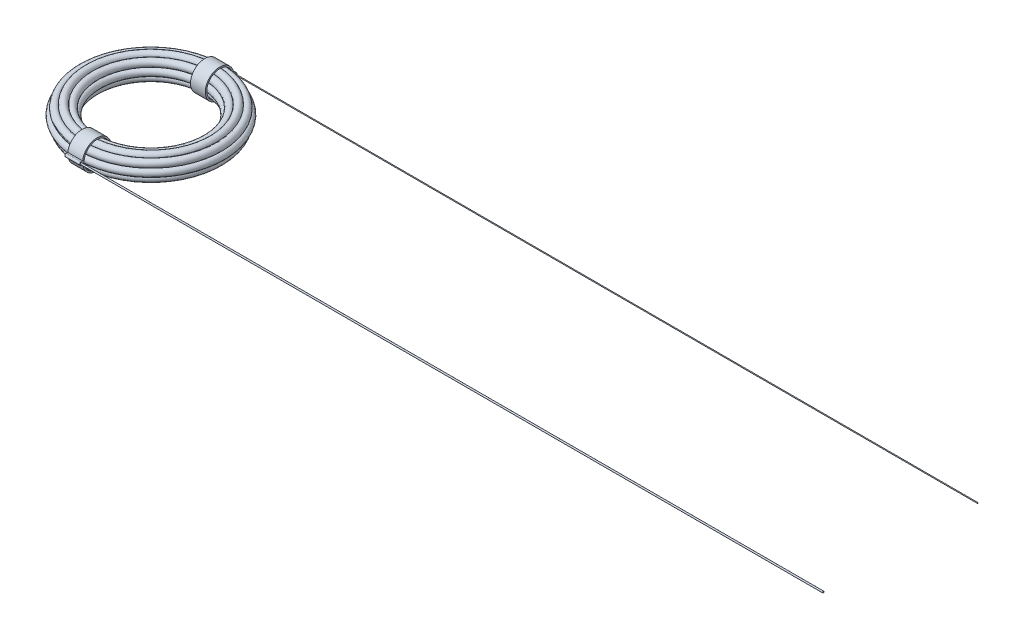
from build123d import *

# Parameters (mm, degrees)
CROQUIS51_R             = 26
SALIENTE_EXTRUIR1_DEPTH = 15
MATRIZC2_COUNT          = 2
CROQUIS55_R             = 1.5
SALIENTE_EXTRUIR2_DEPTH = 1500
CROQUIS56_R             = 0.75
SALIENTE_EXTRUIR3_DEPTH = 1500
CROQUIS57_RX            = 20
CROQUIS57_RY            = 15
CORTAR_EXTRUIR2_DEPTH   = 10
CORTAR_EXTRUIR2_TAPER   = 42
CROQUIS58_R             = 5
SALIENTE_EXTRUIR4_DEPTH = 1


with BuildPart() as part:
    # Croquis1 → Revoluci_n1 (revolve)
    with BuildSketch(Plane(origin=(0, 0, 0), x_dir=(0, 0, -1), z_dir=(1, 0, 0))):
        with BuildLine():
            ThreePointArc((-143.056659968, 7.47931345), (-150, 0), (-143.056659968, -7.47931345))
            ThreePointArc((-143.056659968, -7.47931345), (-142.67766953, -17.67766953), (-132.47931345, -18.056659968))
            ThreePointArc((-132.47931345, -18.056659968), (-125, -25), (-117.52068655, -18.056659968))
            ThreePointArc((-117.52068655, -18.056659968), (-107.32233047, -17.67766953), (-106.943340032, -7.47931345))
            ThreePointArc((-106.943340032, -7.47931345), (-100, 0), (-106.943340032, 7.47931345))
            ThreePointArc((-106.943340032, 7.47931345), (-107.32233047, 17.67766953), (-117.52068655, 18.056659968))
            ThreePointArc((-117.52068655, 18.056659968), (-125, 25), (-132.47931345, 18.056659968))
            ThreePointArc((-132.47931345, 18.056659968), (-142.67766953, 17.67766953), (-143.056659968, 7.47931345))
        make_face()
    revolve(axis=Axis((0, 26.530856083, 0), (0, -1, 0)))

    # Croquis57 → Cortar-Extruir2 (cut)
    with BuildSketch(Plane(origin=(-150, 0, 0), x_dir=(0, 0, -1), z_dir=(1, 0, 0))):
        with Locations((0, 0)):
            Ellipse(CROQUIS57_RX, CROQUIS57_RY)
    extrude(amount=CORTAR_EXTRUIR2_DEPTH, taper=CORTAR_EXTRUIR2_TAPER, mode=Mode.SUBTRACT)


with BuildPart() as body_2:
    # Croquis51 → Saliente-Extruir1 (new, symmetric)
    with BuildSketch(Plane(origin=(0, 0, 0), x_dir=(0, 0, -1), z_dir=(1, 0, 0))):
        with BuildLine():
            Line((-156, -3), (-152.844410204, -3))
            ThreePointArc((-152.844410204, -3), (-95, 0), (-152.844410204, 3))
            Line((-152.844410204, 3), (-156, 3))
            ThreePointArc((-156, 3), (-159, 0), (-156, -3))
        make_face()
        with Locations((-124, 0)):
            Circle(CROQUIS51_R, mode=Mode.SUBTRACT)
    extrude(amount=SALIENTE_EXTRUIR1_DEPTH, both=True)


with BuildPart() as matrizc2_1:
    # MatrizC2: pattern copy
    add(body_2.part.rotate(Axis((0, 26.530856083, 0), (0, -1, 0)), 1 * 360 / MATRIZC2_COUNT))


with BuildPart() as body_4:
    # Croquis55 → Saliente-Extruir2 (new body)
    with BuildSketch(Plane(origin=(15, 0, 0), x_dir=(0, 0, -1), z_dir=(1, 0, 0))):
        with Locations((-156, 0)):
            Circle(CROQUIS55_R)
    extrude(amount=SALIENTE_EXTRUIR2_DEPTH)


with BuildPart() as body_5:
    # Croquis56 → Saliente-Extruir3 (new body)
    with BuildSketch(Plane(origin=(15, 0, 0), x_dir=(0, 0, -1), z_dir=(1, 0, 0))):
        with Locations((156, 0)):
            Circle(CROQUIS56_R)
    extrude(amount=SALIENTE_EXTRUIR3_DEPTH)


with BuildPart() as body_6:
    # Croquis58 → Saliente-Extruir4 (new body)
    with BuildSketch(Plane.ZY.offset(140)):
        Circle(CROQUIS58_R)
    extrude(amount=SALIENTE_EXTRUIR4_DEPTH)


solid = Compound([part.part, body_2.part, matrizc2_1.part, body_4.part, body_5.part, body_6.part])
